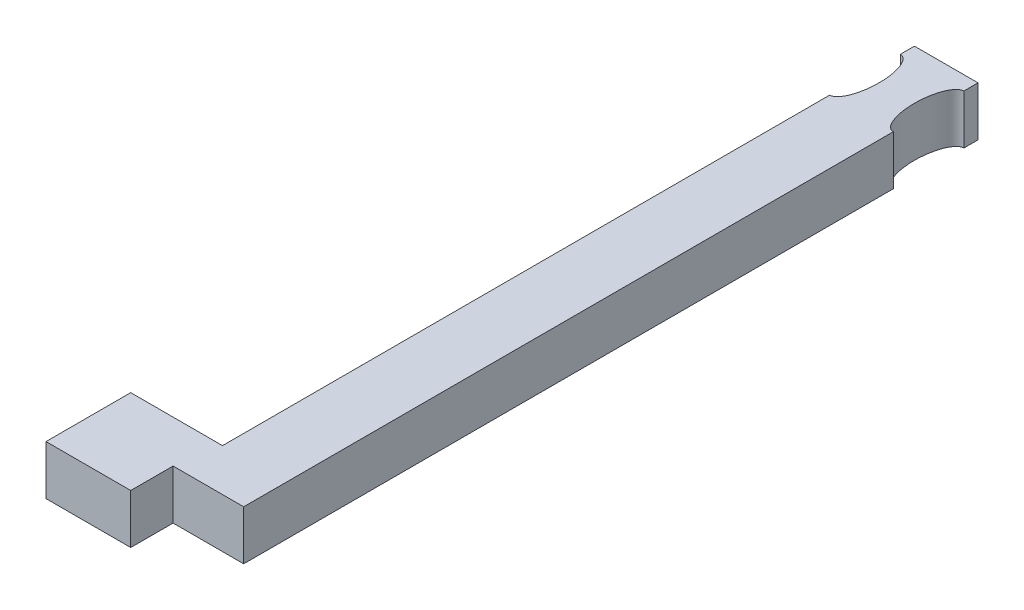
from build123d import *

# Parameters (mm, degrees)
BOSS_EXTRU_1_DEPTH      = 3.5
ESQUISSE2_W             = 3.4
ESQUISSE2_H             = 3.4
ENL_V_MAT_EXTRU_1_DEPTH = 2.5


with BuildPart() as part:
    # Esquisse1 → Boss.-Extru.1 (new body)
    with BuildSketch(Plane(origin=(0, 0, 0), x_dir=(1, 0, 0), z_dir=(0, 1, 0))):
        with BuildLine():
            Line((6, 3), (11, 3))
            Line((11, 3), (11, 49))
            add(Edge.make_bspline(
                [(11, 54), (10, 54), (10, 51.5), (10, 49), (11, 49)],
                knots=[0, 0, 0, 1.570796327, 1.570796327, 3.141592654, 3.141592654, 3.141592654], degree=2, weights=[1, 0.707106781, 1, 0.707106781, 1]))
            Line((11, 54), (11, 55))
            Line((11, 55), (6.5, 55))
            Line((6.5, 55), (6.5, 54))
            add(Edge.make_bspline(
                [(6.5, 49), (7.5, 49), (7.5, 51.5), (7.5, 54), (6.5, 54)],
                knots=[3.141592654, 3.141592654, 3.141592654, 4.71238898, 4.71238898, 6.283185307, 6.283185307, 6.283185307], degree=2, weights=[1, 0.707106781, 1, 0.707106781, 1]))
            Line((6.5, 49), (6.5, 6))
            Line((6.5, 6), (0, 6))
            Line((0, 6), (0, 0))
            Line((0, 0), (6, 0))
            Line((6, 0), (6, 3))
        make_face()
    extrude(amount=BOSS_EXTRU_1_DEPTH)

    # Esquisse2 → Enl_v. mat.-Extru.1 (cut)
    with BuildSketch(Plane.XZ):
        with Locations((3, -3)):
            Rectangle(ESQUISSE2_W, ESQUISSE2_H)
    extrude(amount=-ENL_V_MAT_EXTRU_1_DEPTH, mode=Mode.SUBTRACT)


solid = part.part
